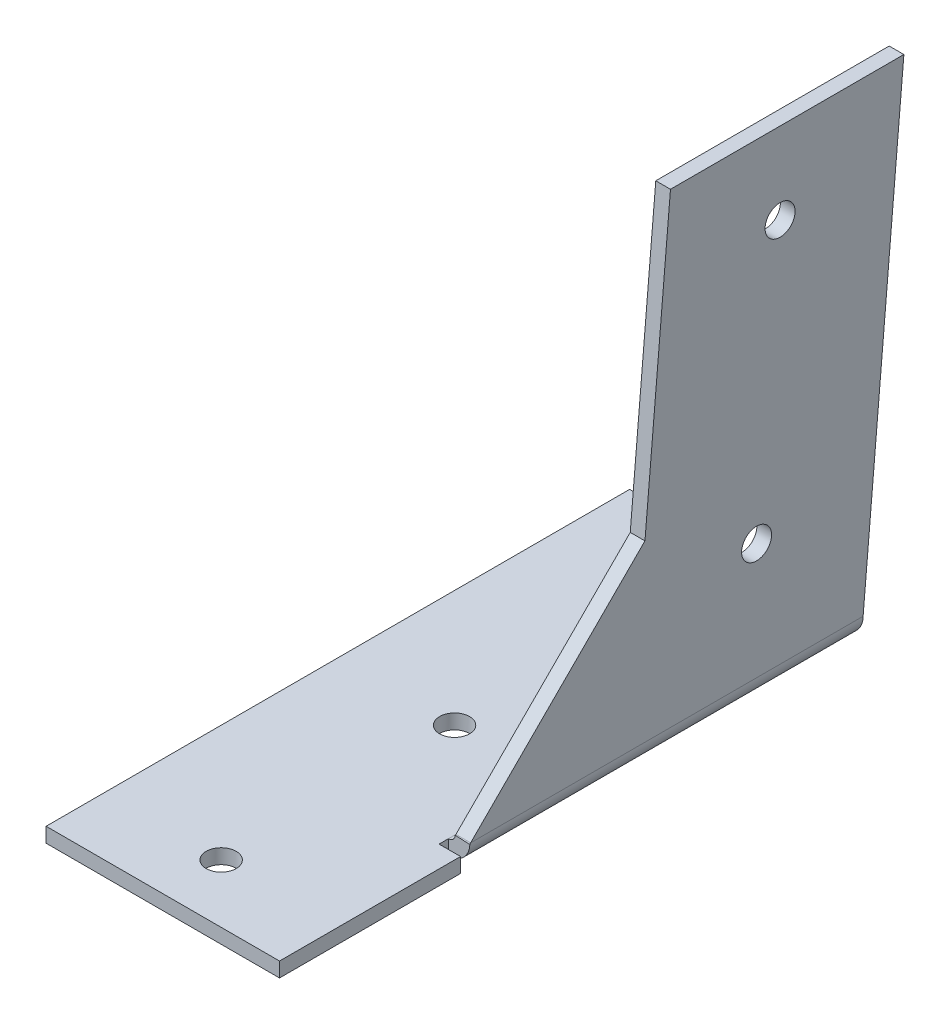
ISO-10303-21;
HEADER;
FILE_DESCRIPTION(('STEP AP214'),'2;1');
FILE_NAME('part.step','',(''),(''),'','','');
FILE_SCHEMA(('AUTOMOTIVE_DESIGN { 1 0 10303 214 1 1 1 1 }'));
ENDSEC;
DATA;
#1=APPLICATION_CONTEXT('core data for automotive mechanical design processes');
#2=APPLICATION_PROTOCOL_DEFINITION('international standard','automotive_design',2000,#1);
#3=PRODUCT_CONTEXT('',#1,'mechanical');
#4=PRODUCT('Part','Part','',(#3));
#5=PRODUCT_RELATED_PRODUCT_CATEGORY('part','',(#4));
#6=PRODUCT_DEFINITION_FORMATION('','',#4);
#7=PRODUCT_DEFINITION_CONTEXT('part definition',#1,'design');
#8=PRODUCT_DEFINITION('design','',#6,#7);
#9=PRODUCT_DEFINITION_SHAPE('','',#8);
#10=(LENGTH_UNIT() NAMED_UNIT(*) SI_UNIT(.MILLI.,.METRE.));
#11=(NAMED_UNIT(*) PLANE_ANGLE_UNIT() SI_UNIT($,.RADIAN.));
#12=(NAMED_UNIT(*) SI_UNIT($,.STERADIAN.) SOLID_ANGLE_UNIT());
#13=UNCERTAINTY_MEASURE_WITH_UNIT(LENGTH_MEASURE(1.E-05),#10,'distance_accuracy_value','');
#14=(GEOMETRIC_REPRESENTATION_CONTEXT(3) GLOBAL_UNCERTAINTY_ASSIGNED_CONTEXT((#13)) GLOBAL_UNIT_ASSIGNED_CONTEXT((#10,
#11,#12)) REPRESENTATION_CONTEXT('',''));
#15=CARTESIAN_POINT('',(0.,0.,0.));
#16=DIRECTION('',(0.,0.,1.));
#17=DIRECTION('',(1.,0.,0.));
#18=AXIS2_PLACEMENT_3D('',#15,#16,#17);
#19=CARTESIAN_POINT('',(12.6999999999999,19.7095572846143,-8.01665904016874));
#20=DIRECTION('',(0.,0.707106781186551,0.707106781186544));
#21=DIRECTION('',(0.,0.707106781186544,-0.707106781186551));
#22=AXIS2_PLACEMENT_3D('',#19,#20,#21);
#23=PLANE('',#22);
#24=DIRECTION('',(0.,0.707106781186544,-0.707106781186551));
#25=VECTOR('',#24,1.);
#26=CARTESIAN_POINT('',(11.0997999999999,19.7095572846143,-8.01665904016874));
#27=LINE('',#26,#25);
#28=CARTESIAN_POINT('',(11.0998,0.736600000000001,10.9562982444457));
#29=VERTEX_POINT('',#28);
#30=CARTESIAN_POINT('',(11.0997999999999,19.7095572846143,-8.01665904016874));
#31=VERTEX_POINT('',#30);
#32=EDGE_CURVE('E204',#29,#31,#27,.T.);
#33=ORIENTED_EDGE('',*,*,#32,.F.);
#34=CARTESIAN_POINT('',(12.7,0.736599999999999,10.9562982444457));
#35=CARTESIAN_POINT('',(11.0998,0.7366,10.9562982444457));
#36=B_SPLINE_CURVE_WITH_KNOTS('',1,(#34,#35),.UNSPECIFIED.,.F.,.F.,(2,2),(0.,1.),.UNSPECIFIED.);
#37=CARTESIAN_POINT('',(12.7,0.736600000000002,10.9562982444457));
#38=VERTEX_POINT('',#37);
#39=EDGE_CURVE('E180',#29,#38,#36,.F.);
#40=ORIENTED_EDGE('',*,*,#39,.T.);
#41=DIRECTION('',(0.,0.707106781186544,-0.707106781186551));
#42=VECTOR('',#41,1.);
#43=CARTESIAN_POINT('',(12.6999999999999,19.7095572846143,-8.01665904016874));
#44=LINE('',#43,#42);
#45=CARTESIAN_POINT('',(12.6999999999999,19.7095572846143,-8.01665904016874));
#46=VERTEX_POINT('',#45);
#47=EDGE_CURVE('E106',#38,#46,#44,.T.);
#48=ORIENTED_EDGE('',*,*,#47,.T.);
#49=DIRECTION('',(-1.,0.,0.));
#50=VECTOR('',#49,1.);
#51=CARTESIAN_POINT('',(12.6999999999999,19.7095572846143,-8.01665904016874));
#52=LINE('',#51,#50);
#53=EDGE_CURVE('E421',#46,#31,#52,.T.);
#54=ORIENTED_EDGE('',*,*,#53,.T.);
#55=EDGE_LOOP('',(#33,#40,#48,#54));
#56=FACE_BOUND('',#55,.T.);
#57=ADVANCED_FACE('F56',(#56),#23,.T.);
#58=CARTESIAN_POINT('',(12.7,0.659557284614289,-31.75));
#59=DIRECTION('',(0.,-0.0871557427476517,-0.996194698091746));
#60=DIRECTION('',(0.,-0.996194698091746,0.0871557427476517));
#61=AXIS2_PLACEMENT_3D('',#58,#59,#60);
#62=PLANE('',#61);
#63=DIRECTION('',(0.,-0.996194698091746,0.0871557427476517));
#64=VECTOR('',#63,1.);
#65=CARTESIAN_POINT('',(12.7,0.659557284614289,-31.75));
#66=LINE('',#65,#64);
#67=CARTESIAN_POINT('',(12.6999999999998,51.4595572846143,-36.1944241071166));
#68=VERTEX_POINT('',#67);
#69=CARTESIAN_POINT('',(12.7,0.736600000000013,-31.7567403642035));
#70=VERTEX_POINT('',#69);
#71=EDGE_CURVE('E258',#68,#70,#66,.T.);
#72=ORIENTED_EDGE('',*,*,#71,.T.);
#73=CARTESIAN_POINT('',(11.0998,0.7366,-31.7567403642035));
#74=CARTESIAN_POINT('',(12.7,0.736599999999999,-31.7567403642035));
#75=B_SPLINE_CURVE_WITH_KNOTS('',1,(#73,#74),.UNSPECIFIED.,.F.,.F.,(2,2),(0.,1.),.UNSPECIFIED.);
#76=CARTESIAN_POINT('',(11.0998,0.736600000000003,-31.7567403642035));
#77=VERTEX_POINT('',#76);
#78=EDGE_CURVE('E12',#70,#77,#75,.F.);
#79=ORIENTED_EDGE('',*,*,#78,.T.);
#80=DIRECTION('',(0.,-0.996194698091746,0.0871557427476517));
#81=VECTOR('',#80,1.);
#82=CARTESIAN_POINT('',(11.0998,0.659557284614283,-31.75));
#83=LINE('',#82,#81);
#84=CARTESIAN_POINT('',(11.0997999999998,51.4595572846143,-36.1944241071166));
#85=VERTEX_POINT('',#84);
#86=EDGE_CURVE('E200',#85,#77,#83,.T.);
#87=ORIENTED_EDGE('',*,*,#86,.F.);
#88=DIRECTION('',(-1.,0.,0.));
#89=VECTOR('',#88,1.);
#90=CARTESIAN_POINT('',(12.6999999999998,51.4595572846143,-36.1944241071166));
#91=LINE('',#90,#89);
#92=EDGE_CURVE('E84',#68,#85,#91,.T.);
#93=ORIENTED_EDGE('',*,*,#92,.F.);
#94=EDGE_LOOP('',(#72,#79,#87,#93));
#95=FACE_BOUND('',#94,.T.);
#96=ADVANCED_FACE('F58',(#95),#62,.T.);
#97=CARTESIAN_POINT('',(12.7,-12.0404427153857,0.));
#98=DIRECTION('',(1.,0.,0.));
#99=DIRECTION('',(0.,0.,-1.));
#100=AXIS2_PLACEMENT_3D('',#97,#98,#99);
#101=PLANE('',#100);
#102=CARTESIAN_POINT('',(12.6999999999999,42.6033864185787,-22.71960955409));
#103=DIRECTION('',(1.,0.,0.));
#104=DIRECTION('',(0.,1.,0.));
#105=AXIS2_PLACEMENT_3D('',#102,#103,#104);
#106=CIRCLE('',#105,1.63195);
#107=CARTESIAN_POINT('',(12.6999999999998,44.2353364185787,-22.71960955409));
#108=VERTEX_POINT('',#107);
#109=EDGE_CURVE('E524',#108,#108,#106,.T.);
#110=ORIENTED_EDGE('',*,*,#109,.F.);
#111=EDGE_LOOP('',(#110));
#112=FACE_BOUND('',#111,.T.);
#113=CARTESIAN_POINT('',(12.7,13.3882726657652,-20.1636182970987));
#114=DIRECTION('',(1.,0.,0.));
#115=DIRECTION('',(0.,1.,0.));
#116=AXIS2_PLACEMENT_3D('',#113,#114,#115);
#117=CIRCLE('',#116,1.63195);
#118=CARTESIAN_POINT('',(12.6999999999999,15.0202226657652,-20.1636182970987));
#119=VERTEX_POINT('',#118);
#120=EDGE_CURVE('E529',#119,#119,#117,.T.);
#121=ORIENTED_EDGE('',*,*,#120,.F.);
#122=EDGE_LOOP('',(#121));
#123=FACE_BOUND('',#122,.T.);
#124=ORIENTED_EDGE('',*,*,#47,.F.);
#125=DIRECTION('',(0.,0.,-1.));
#126=VECTOR('',#125,1.);
#127=CARTESIAN_POINT('',(12.7,0.736600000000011,0.));
#128=LINE('',#127,#126);
#129=EDGE_CURVE('E171',#38,#70,#128,.T.);
#130=ORIENTED_EDGE('',*,*,#129,.T.);
#131=ORIENTED_EDGE('',*,*,#71,.F.);
#132=DIRECTION('',(0.,0.,-1.));
#133=VECTOR('',#132,1.);
#134=CARTESIAN_POINT('',(12.6999999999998,51.4595572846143,-36.1944241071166));
#135=LINE('',#134,#133);
#136=CARTESIAN_POINT('',(12.6999999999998,51.4595572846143,-10.7944241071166));
#137=VERTEX_POINT('',#136);
#138=EDGE_CURVE('E413',#137,#68,#135,.T.);
#139=ORIENTED_EDGE('',*,*,#138,.F.);
#140=DIRECTION('',(0.,0.996194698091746,-0.0871557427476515));
#141=VECTOR('',#140,1.);
#142=CARTESIAN_POINT('',(12.6999999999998,51.4595572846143,-10.7944241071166));
#143=LINE('',#142,#141);
#144=EDGE_CURVE('E199',#46,#137,#143,.T.);
#145=ORIENTED_EDGE('',*,*,#144,.F.);
#146=EDGE_LOOP('',(#124,#130,#131,#139,#145));
#147=FACE_BOUND('',#146,.T.);
#148=ADVANCED_FACE('F196',(#112,#123,#147),#101,.T.);
#149=CARTESIAN_POINT('',(12.6999999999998,51.4595572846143,-36.1944241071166));
#150=DIRECTION('',(0.,1.,0.));
#151=DIRECTION('',(0.,0.,-1.));
#152=AXIS2_PLACEMENT_3D('',#149,#150,#151);
#153=PLANE('',#152);
#154=DIRECTION('',(0.,0.,-1.));
#155=VECTOR('',#154,1.);
#156=CARTESIAN_POINT('',(11.0997999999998,51.4595572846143,-36.1944241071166));
#157=LINE('',#156,#155);
#158=CARTESIAN_POINT('',(11.0997999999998,51.4595572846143,-10.7944241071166));
#159=VERTEX_POINT('',#158);
#160=EDGE_CURVE('E256',#159,#85,#157,.T.);
#161=ORIENTED_EDGE('',*,*,#160,.F.);
#162=DIRECTION('',(-1.,0.,0.));
#163=VECTOR('',#162,1.);
#164=CARTESIAN_POINT('',(12.6999999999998,51.4595572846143,-10.7944241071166));
#165=LINE('',#164,#163);
#166=EDGE_CURVE('E419',#137,#159,#165,.T.);
#167=ORIENTED_EDGE('',*,*,#166,.F.);
#168=ORIENTED_EDGE('',*,*,#138,.T.);
#169=ORIENTED_EDGE('',*,*,#92,.T.);
#170=EDGE_LOOP('',(#161,#167,#168,#169));
#171=FACE_BOUND('',#170,.T.);
#172=ADVANCED_FACE('F235',(#171),#153,.T.);
#173=CARTESIAN_POINT('',(12.6999999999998,51.4595572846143,-10.7944241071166));
#174=DIRECTION('',(0.,0.0871557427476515,0.996194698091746));
#175=DIRECTION('',(0.,0.996194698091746,-0.0871557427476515));
#176=AXIS2_PLACEMENT_3D('',#173,#174,#175);
#177=PLANE('',#176);
#178=DIRECTION('',(0.,0.996194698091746,-0.0871557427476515));
#179=VECTOR('',#178,1.);
#180=CARTESIAN_POINT('',(11.0997999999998,51.4595572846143,-10.7944241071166));
#181=LINE('',#180,#179);
#182=EDGE_CURVE('E415',#31,#159,#181,.T.);
#183=ORIENTED_EDGE('',*,*,#182,.F.);
#184=ORIENTED_EDGE('',*,*,#53,.F.);
#185=ORIENTED_EDGE('',*,*,#144,.T.);
#186=ORIENTED_EDGE('',*,*,#166,.T.);
#187=EDGE_LOOP('',(#183,#184,#185,#186));
#188=FACE_BOUND('',#187,.T.);
#189=ADVANCED_FACE('F226',(#188),#177,.T.);
#190=CARTESIAN_POINT('',(11.0998,-12.0404427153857,0.));
#191=DIRECTION('',(1.,0.,0.));
#192=DIRECTION('',(0.,0.,-1.));
#193=AXIS2_PLACEMENT_3D('',#190,#191,#192);
#194=PLANE('',#193);
#195=CARTESIAN_POINT('',(11.0997999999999,42.6033864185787,-22.71960955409));
#196=DIRECTION('',(-1.,0.,0.));
#197=DIRECTION('',(0.,-1.,0.));
#198=AXIS2_PLACEMENT_3D('',#195,#196,#197);
#199=CIRCLE('',#198,1.63195);
#200=CARTESIAN_POINT('',(11.0997999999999,40.9714364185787,-22.71960955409));
#201=VERTEX_POINT('',#200);
#202=EDGE_CURVE('E240',#201,#201,#199,.T.);
#203=ORIENTED_EDGE('',*,*,#202,.F.);
#204=EDGE_LOOP('',(#203));
#205=FACE_BOUND('',#204,.T.);
#206=CARTESIAN_POINT('',(11.0998,13.3882726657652,-20.1636182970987));
#207=DIRECTION('',(-1.,0.,0.));
#208=DIRECTION('',(0.,-1.,0.));
#209=AXIS2_PLACEMENT_3D('',#206,#207,#208);
#210=CIRCLE('',#209,1.63195);
#211=CARTESIAN_POINT('',(11.0998,11.7563226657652,-20.1636182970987));
#212=VERTEX_POINT('',#211);
#213=EDGE_CURVE('E244',#212,#212,#210,.T.);
#214=ORIENTED_EDGE('',*,*,#213,.F.);
#215=EDGE_LOOP('',(#214));
#216=FACE_BOUND('',#215,.T.);
#217=DIRECTION('',(0.,0.,-1.));
#218=VECTOR('',#217,1.);
#219=CARTESIAN_POINT('',(11.0998,0.736600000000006,0.));
#220=LINE('',#219,#218);
#221=EDGE_CURVE('E67',#29,#77,#220,.T.);
#222=ORIENTED_EDGE('',*,*,#221,.F.);
#223=ORIENTED_EDGE('',*,*,#32,.T.);
#224=ORIENTED_EDGE('',*,*,#182,.T.);
#225=ORIENTED_EDGE('',*,*,#160,.T.);
#226=ORIENTED_EDGE('',*,*,#86,.T.);
#227=EDGE_LOOP('',(#222,#223,#224,#225,#226));
#228=FACE_BOUND('',#227,.T.);
#229=ADVANCED_FACE('F223',(#205,#216,#228),#194,.F.);
#230=CARTESIAN_POINT('',(-12.7,-1.6002,31.75));
#231=DIRECTION('',(-1.,0.,0.));
#232=DIRECTION('',(0.,0.,1.));
#233=AXIS2_PLACEMENT_3D('',#230,#231,#232);
#234=PLANE('',#233);
#235=DIRECTION('',(0.,0.,1.));
#236=VECTOR('',#235,1.);
#237=CARTESIAN_POINT('',(-12.7,0.,31.75));
#238=LINE('',#237,#236);
#239=CARTESIAN_POINT('',(-12.7,0.,-31.75));
#240=VERTEX_POINT('',#239);
#241=CARTESIAN_POINT('',(-12.7,0.,31.75));
#242=VERTEX_POINT('',#241);
#243=EDGE_CURVE('E371',#240,#242,#238,.T.);
#244=ORIENTED_EDGE('',*,*,#243,.F.);
#245=DIRECTION('',(0.,1.,0.));
#246=VECTOR('',#245,1.);
#247=CARTESIAN_POINT('',(-12.7,-1.6002,-31.75));
#248=LINE('',#247,#246);
#249=CARTESIAN_POINT('',(-12.7,-1.6002,-31.75));
#250=VERTEX_POINT('',#249);
#251=EDGE_CURVE('E352',#250,#240,#248,.T.);
#252=ORIENTED_EDGE('',*,*,#251,.F.);
#253=DIRECTION('',(0.,0.,1.));
#254=VECTOR('',#253,1.);
#255=CARTESIAN_POINT('',(-12.7,-1.6002,31.75));
#256=LINE('',#255,#254);
#257=CARTESIAN_POINT('',(-12.7,-1.6002,31.75));
#258=VERTEX_POINT('',#257);
#259=EDGE_CURVE('E405',#250,#258,#256,.T.);
#260=ORIENTED_EDGE('',*,*,#259,.T.);
#261=DIRECTION('',(0.,1.,0.));
#262=VECTOR('',#261,1.);
#263=CARTESIAN_POINT('',(-12.7,-1.6002,31.75));
#264=LINE('',#263,#262);
#265=EDGE_CURVE('E403',#258,#242,#264,.T.);
#266=ORIENTED_EDGE('',*,*,#265,.T.);
#267=EDGE_LOOP('',(#244,#252,#260,#266));
#268=FACE_BOUND('',#267,.T.);
#269=ADVANCED_FACE('F225',(#268),#234,.T.);
#270=CARTESIAN_POINT('',(-12.7,-1.6002,31.75));
#271=DIRECTION('',(0.,0.,1.));
#272=DIRECTION('',(1.,0.,0.));
#273=AXIS2_PLACEMENT_3D('',#270,#271,#272);
#274=PLANE('',#273);
#275=DIRECTION('',(1.,0.,0.));
#276=VECTOR('',#275,1.);
#277=CARTESIAN_POINT('',(-12.7,0.,31.75));
#278=LINE('',#277,#276);
#279=CARTESIAN_POINT('',(12.7,0.,31.75));
#280=VERTEX_POINT('',#279);
#281=EDGE_CURVE('E368',#242,#280,#278,.T.);
#282=ORIENTED_EDGE('',*,*,#281,.F.);
#283=ORIENTED_EDGE('',*,*,#265,.F.);
#284=DIRECTION('',(1.,0.,0.));
#285=VECTOR('',#284,1.);
#286=CARTESIAN_POINT('',(-12.7,-1.6002,31.75));
#287=LINE('',#286,#285);
#288=CARTESIAN_POINT('',(12.7,-1.6002,31.75));
#289=VERTEX_POINT('',#288);
#290=EDGE_CURVE('E400',#258,#289,#287,.T.);
#291=ORIENTED_EDGE('',*,*,#290,.T.);
#292=DIRECTION('',(0.,1.,0.));
#293=VECTOR('',#292,1.);
#294=CARTESIAN_POINT('',(12.7,-1.6002,31.75));
#295=LINE('',#294,#293);
#296=EDGE_CURVE('E398',#289,#280,#295,.T.);
#297=ORIENTED_EDGE('',*,*,#296,.T.);
#298=EDGE_LOOP('',(#282,#283,#291,#297));
#299=FACE_BOUND('',#298,.T.);
#300=ADVANCED_FACE('F232',(#299),#274,.T.);
#301=CARTESIAN_POINT('',(12.7,-1.6002,31.75));
#302=DIRECTION('',(1.,0.,0.));
#303=DIRECTION('',(0.,0.,-1.));
#304=AXIS2_PLACEMENT_3D('',#301,#302,#303);
#305=PLANE('',#304);
#306=DIRECTION('',(0.,0.,-1.));
#307=VECTOR('',#306,1.);
#308=CARTESIAN_POINT('',(12.7,0.,31.75));
#309=LINE('',#308,#307);
#310=CARTESIAN_POINT('',(12.7,0.,12.0493409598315));
#311=VERTEX_POINT('',#310);
#312=EDGE_CURVE('E365',#280,#311,#309,.T.);
#313=ORIENTED_EDGE('',*,*,#312,.F.);
#314=ORIENTED_EDGE('',*,*,#296,.F.);
#315=DIRECTION('',(0.,0.,-1.));
#316=VECTOR('',#315,1.);
#317=CARTESIAN_POINT('',(12.7,-1.6002,31.75));
#318=LINE('',#317,#316);
#319=CARTESIAN_POINT('',(12.7,-1.6002,12.0493409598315));
#320=VERTEX_POINT('',#319);
#321=EDGE_CURVE('E395',#289,#320,#318,.T.);
#322=ORIENTED_EDGE('',*,*,#321,.T.);
#323=DIRECTION('',(0.,1.,0.));
#324=VECTOR('',#323,1.);
#325=CARTESIAN_POINT('',(12.7,-1.6002,12.0493409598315));
#326=LINE('',#325,#324);
#327=EDGE_CURVE('E393',#320,#311,#326,.T.);
#328=ORIENTED_EDGE('',*,*,#327,.T.);
#329=EDGE_LOOP('',(#313,#314,#322,#328));
#330=FACE_BOUND('',#329,.T.);
#331=ADVANCED_FACE('F454',(#330),#305,.T.);
#332=CARTESIAN_POINT('',(10.3632,-1.6002,12.0493409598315));
#333=DIRECTION('',(0.,0.,-1.));
#334=DIRECTION('',(-1.,0.,0.));
#335=AXIS2_PLACEMENT_3D('',#332,#333,#334);
#336=PLANE('',#335);
#337=DIRECTION('',(-1.,0.,0.));
#338=VECTOR('',#337,1.);
#339=CARTESIAN_POINT('',(10.3632,0.,12.0493409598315));
#340=LINE('',#339,#338);
#341=CARTESIAN_POINT('',(10.3632,0.,12.0493409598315));
#342=VERTEX_POINT('',#341);
#343=EDGE_CURVE('E362',#311,#342,#340,.T.);
#344=ORIENTED_EDGE('',*,*,#343,.F.);
#345=ORIENTED_EDGE('',*,*,#327,.F.);
#346=DIRECTION('',(-1.,0.,0.));
#347=VECTOR('',#346,1.);
#348=CARTESIAN_POINT('',(10.3632,-1.6002,12.0493409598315));
#349=LINE('',#348,#347);
#350=CARTESIAN_POINT('',(10.3632,-1.6002,12.0493409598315));
#351=VERTEX_POINT('',#350);
#352=EDGE_CURVE('E390',#320,#351,#349,.T.);
#353=ORIENTED_EDGE('',*,*,#352,.T.);
#354=DIRECTION('',(0.,1.,0.));
#355=VECTOR('',#354,1.);
#356=CARTESIAN_POINT('',(10.3632,-1.6002,12.0493409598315));
#357=LINE('',#356,#355);
#358=EDGE_CURVE('E388',#351,#342,#357,.T.);
#359=ORIENTED_EDGE('',*,*,#358,.T.);
#360=EDGE_LOOP('',(#344,#345,#353,#359));
#361=FACE_BOUND('',#360,.T.);
#362=ADVANCED_FACE('F450',(#361),#336,.T.);
#363=CARTESIAN_POINT('',(0.,-1.6002,0.));
#364=DIRECTION('',(0.,-1.,0.));
#365=DIRECTION('',(0.,0.,-1.));
#366=AXIS2_PLACEMENT_3D('',#363,#364,#365);
#367=PLANE('',#366);
#368=CARTESIAN_POINT('',(0.,-1.6002,25.4));
#369=DIRECTION('',(0.,-1.,0.));
#370=DIRECTION('',(0.,0.,-1.));
#371=AXIS2_PLACEMENT_3D('',#368,#369,#370);
#372=CIRCLE('',#371,1.63195);
#373=CARTESIAN_POINT('',(0.,-1.6002,23.76805));
#374=VERTEX_POINT('',#373);
#375=EDGE_CURVE('E502',#374,#374,#372,.T.);
#376=ORIENTED_EDGE('',*,*,#375,.F.);
#377=EDGE_LOOP('',(#376));
#378=FACE_BOUND('',#377,.T.);
#379=CARTESIAN_POINT('',(0.,-1.6002,-25.4));
#380=DIRECTION('',(0.,-1.,0.));
#381=DIRECTION('',(0.,0.,-1.));
#382=AXIS2_PLACEMENT_3D('',#379,#380,#381);
#383=CIRCLE('',#382,1.63195);
#384=CARTESIAN_POINT('',(0.,-1.6002,-27.03195));
#385=VERTEX_POINT('',#384);
#386=EDGE_CURVE('E506',#385,#385,#383,.T.);
#387=ORIENTED_EDGE('',*,*,#386,.F.);
#388=EDGE_LOOP('',(#387));
#389=FACE_BOUND('',#388,.T.);
#390=CARTESIAN_POINT('',(0.,-1.6002,0.));
#391=DIRECTION('',(0.,-1.,0.));
#392=DIRECTION('',(0.,0.,-1.));
#393=AXIS2_PLACEMENT_3D('',#390,#391,#392);
#394=CIRCLE('',#393,1.63195);
#395=CARTESIAN_POINT('',(0.,-1.6002,-1.63195));
#396=VERTEX_POINT('',#395);
#397=EDGE_CURVE('E511',#396,#396,#394,.T.);
#398=ORIENTED_EDGE('',*,*,#397,.F.);
#399=EDGE_LOOP('',(#398));
#400=FACE_BOUND('',#399,.T.);
#401=DIRECTION('',(0.,0.,-1.));
#402=VECTOR('',#401,1.);
#403=CARTESIAN_POINT('',(10.3632,-1.6002,0.));
#404=LINE('',#403,#402);
#405=CARTESIAN_POINT('',(10.3632,-1.6002,11.0333409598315));
#406=VERTEX_POINT('',#405);
#407=CARTESIAN_POINT('',(10.3632,-1.6002,-31.75));
#408=VERTEX_POINT('',#407);
#409=EDGE_CURVE('E410',#406,#408,#404,.T.);
#410=ORIENTED_EDGE('',*,*,#409,.F.);
#411=DIRECTION('',(0.,0.,-1.));
#412=VECTOR('',#411,1.);
#413=CARTESIAN_POINT('',(10.3632,-1.6002,11.0333409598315));
#414=LINE('',#413,#412);
#415=EDGE_CURVE('E385',#351,#406,#414,.T.);
#416=ORIENTED_EDGE('',*,*,#415,.F.);
#417=ORIENTED_EDGE('',*,*,#352,.F.);
#418=ORIENTED_EDGE('',*,*,#321,.F.);
#419=ORIENTED_EDGE('',*,*,#290,.F.);
#420=ORIENTED_EDGE('',*,*,#259,.F.);
#421=DIRECTION('',(-1.,0.,0.));
#422=VECTOR('',#421,1.);
#423=CARTESIAN_POINT('',(-12.7,-1.6002,-31.75));
#424=LINE('',#423,#422);
#425=EDGE_CURVE('E360',#408,#250,#424,.T.);
#426=ORIENTED_EDGE('',*,*,#425,.F.);
#427=EDGE_LOOP('',(#410,#416,#417,#418,#419,#420,#426));
#428=FACE_BOUND('',#427,.T.);
#429=ADVANCED_FACE('F446',(#378,#389,#400,#428),#367,.T.);
#430=CARTESIAN_POINT('',(10.3632,-1.6002,11.0333409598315));
#431=DIRECTION('',(1.,0.,0.));
#432=DIRECTION('',(0.,0.,-1.));
#433=AXIS2_PLACEMENT_3D('',#430,#431,#432);
#434=PLANE('',#433);
#435=DIRECTION('',(0.,0.,-1.));
#436=VECTOR('',#435,1.);
#437=CARTESIAN_POINT('',(10.3632,0.,11.0333409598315));
#438=LINE('',#437,#436);
#439=CARTESIAN_POINT('',(10.3632,0.,11.0333409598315));
#440=VERTEX_POINT('',#439);
#441=EDGE_CURVE('E379',#342,#440,#438,.T.);
#442=ORIENTED_EDGE('',*,*,#441,.F.);
#443=ORIENTED_EDGE('',*,*,#358,.F.);
#444=ORIENTED_EDGE('',*,*,#415,.T.);
#445=DIRECTION('',(0.,1.,0.));
#446=VECTOR('',#445,1.);
#447=CARTESIAN_POINT('',(10.3632,-1.6002,11.0333409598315));
#448=LINE('',#447,#446);
#449=EDGE_CURVE('E382',#406,#440,#448,.T.);
#450=ORIENTED_EDGE('',*,*,#449,.T.);
#451=EDGE_LOOP('',(#442,#443,#444,#450));
#452=FACE_BOUND('',#451,.T.);
#453=ADVANCED_FACE('F442',(#452),#434,.T.);
#454=CARTESIAN_POINT('',(0.,0.,0.));
#455=DIRECTION('',(0.,-1.,0.));
#456=DIRECTION('',(0.,0.,-1.));
#457=AXIS2_PLACEMENT_3D('',#454,#455,#456);
#458=PLANE('',#457);
#459=CARTESIAN_POINT('',(0.,0.,25.4));
#460=DIRECTION('',(0.,1.,0.));
#461=DIRECTION('',(0.,0.,1.));
#462=AXIS2_PLACEMENT_3D('',#459,#460,#461);
#463=CIRCLE('',#462,1.63195);
#464=CARTESIAN_POINT('',(0.,0.,27.03195));
#465=VERTEX_POINT('',#464);
#466=EDGE_CURVE('E521',#465,#465,#463,.T.);
#467=ORIENTED_EDGE('',*,*,#466,.F.);
#468=EDGE_LOOP('',(#467));
#469=FACE_BOUND('',#468,.T.);
#470=CARTESIAN_POINT('',(0.,0.,-25.4));
#471=DIRECTION('',(0.,1.,0.));
#472=DIRECTION('',(0.,0.,1.));
#473=AXIS2_PLACEMENT_3D('',#470,#471,#472);
#474=CIRCLE('',#473,1.63195);
#475=CARTESIAN_POINT('',(0.,0.,-23.76805));
#476=VERTEX_POINT('',#475);
#477=EDGE_CURVE('E520',#476,#476,#474,.T.);
#478=ORIENTED_EDGE('',*,*,#477,.F.);
#479=EDGE_LOOP('',(#478));
#480=FACE_BOUND('',#479,.T.);
#481=CARTESIAN_POINT('',(0.,0.,0.));
#482=DIRECTION('',(0.,1.,0.));
#483=DIRECTION('',(0.,0.,1.));
#484=AXIS2_PLACEMENT_3D('',#481,#482,#483);
#485=CIRCLE('',#484,1.63195);
#486=CARTESIAN_POINT('',(0.,0.,1.63195));
#487=VERTEX_POINT('',#486);
#488=EDGE_CURVE('E517',#487,#487,#485,.T.);
#489=ORIENTED_EDGE('',*,*,#488,.F.);
#490=EDGE_LOOP('',(#489));
#491=FACE_BOUND('',#490,.T.);
#492=ORIENTED_EDGE('',*,*,#441,.T.);
#493=DIRECTION('',(0.,0.,-1.));
#494=VECTOR('',#493,1.);
#495=CARTESIAN_POINT('',(10.3632,0.,0.));
#496=LINE('',#495,#494);
#497=CARTESIAN_POINT('',(10.3632,0.,-31.75));
#498=VERTEX_POINT('',#497);
#499=EDGE_CURVE('E376',#440,#498,#496,.T.);
#500=ORIENTED_EDGE('',*,*,#499,.T.);
#501=DIRECTION('',(-1.,0.,0.));
#502=VECTOR('',#501,1.);
#503=CARTESIAN_POINT('',(-12.7,0.,-31.75));
#504=LINE('',#503,#502);
#505=EDGE_CURVE('E374',#498,#240,#504,.T.);
#506=ORIENTED_EDGE('',*,*,#505,.T.);
#507=ORIENTED_EDGE('',*,*,#243,.T.);
#508=ORIENTED_EDGE('',*,*,#281,.T.);
#509=ORIENTED_EDGE('',*,*,#312,.T.);
#510=ORIENTED_EDGE('',*,*,#343,.T.);
#511=EDGE_LOOP('',(#492,#500,#506,#507,#508,#509,#510));
#512=FACE_BOUND('',#511,.T.);
#513=ADVANCED_FACE('F438',(#469,#480,#491,#512),#458,.F.);
#514=CARTESIAN_POINT('',(-12.7,-1.6002,-31.75));
#515=DIRECTION('',(0.,0.,-1.));
#516=DIRECTION('',(-1.,0.,0.));
#517=AXIS2_PLACEMENT_3D('',#514,#515,#516);
#518=PLANE('',#517);
#519=DIRECTION('',(0.,1.,0.));
#520=VECTOR('',#519,1.);
#521=CARTESIAN_POINT('',(10.3632,-1.6002,-31.75));
#522=LINE('',#521,#520);
#523=EDGE_CURVE('E408',#408,#498,#522,.T.);
#524=ORIENTED_EDGE('',*,*,#523,.F.);
#525=ORIENTED_EDGE('',*,*,#425,.T.);
#526=ORIENTED_EDGE('',*,*,#251,.T.);
#527=ORIENTED_EDGE('',*,*,#505,.F.);
#528=EDGE_LOOP('',(#524,#525,#526,#527));
#529=FACE_BOUND('',#528,.T.);
#530=ADVANCED_FACE('F435',(#529),#518,.T.);
#531=CARTESIAN_POINT('',(12.7,0.736599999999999,10.9562982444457));
#532=CARTESIAN_POINT('',(12.7,0.697548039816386,10.9819791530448));
#533=CARTESIAN_POINT('',(12.6990208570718,0.65849609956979,11.0076600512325));
#534=CARTESIAN_POINT('',(12.6970638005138,0.619493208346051,11.0333409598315));
#535=CARTESIAN_POINT('',(11.0998,0.7366,10.9562982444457));
#536=CARTESIAN_POINT('',(11.0998,0.724290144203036,10.9819791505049));
#537=CARTESIAN_POINT('',(11.0994913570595,0.711980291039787,11.0076600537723));
#538=CARTESIAN_POINT('',(11.0988744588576,0.69968590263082,11.0333409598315));
#539=B_SPLINE_SURFACE_WITH_KNOTS('',1,3,((#531,#532,#533,#534),(#535,#536,#537,#538)),
.UNSPECIFIED.,.F.,.F.,.F.,(2,2),(4,4),(0.,1.),(0.,1.),.UNSPECIFIED.);
#540=CARTESIAN_POINT('',(11.0998,0.7366,10.9562982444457));
#541=CARTESIAN_POINT('',(11.0998,0.724290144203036,10.9819791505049));
#542=CARTESIAN_POINT('',(11.0994913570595,0.711980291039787,11.0076600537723));
#543=CARTESIAN_POINT('',(11.0988744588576,0.69968590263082,11.0333409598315));
#544=B_SPLINE_CURVE_WITH_KNOTS('',3,(#540,#541,#542,#543),.UNSPECIFIED.,.F.,.F.,(4,4),(0.,1.),.UNSPECIFIED.);
#545=CARTESIAN_POINT('',(11.0988744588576,0.69968590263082,11.0333409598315));
#546=VERTEX_POINT('',#545);
#547=EDGE_CURVE('E492',#29,#546,#544,.T.);
#548=CARTESIAN_POINT('',(11.0988744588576,0.69968590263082,11.0333409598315));
#549=CARTESIAN_POINT('',(12.6970638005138,0.619493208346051,11.0333409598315));
#550=B_SPLINE_CURVE_WITH_KNOTS('',1,(#548,#549),.UNSPECIFIED.,.F.,.F.,(2,2),(0.,1.),.UNSPECIFIED.);
#551=CARTESIAN_POINT('',(12.6970638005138,0.619493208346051,11.0333409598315));
#552=VERTEX_POINT('',#551);
#553=EDGE_CURVE('E188',#546,#552,#550,.T.);
#554=CARTESIAN_POINT('',(12.6970638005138,0.619493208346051,11.0333409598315));
#555=CARTESIAN_POINT('',(12.6990208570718,0.65849609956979,11.0076600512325));
#556=CARTESIAN_POINT('',(12.7,0.697548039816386,10.9819791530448));
#557=CARTESIAN_POINT('',(12.7,0.736599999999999,10.9562982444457));
#558=B_SPLINE_CURVE_WITH_KNOTS('',3,(#554,#555,#556,#557),.UNSPECIFIED.,.F.,.F.,(4,4),(0.,1.),.UNSPECIFIED.);
#559=EDGE_CURVE('E175',#38,#552,#558,.F.);
#560=ORIENTED_EDGE('',*,*,#39,.F.);
#561=ORIENTED_EDGE('',*,*,#547,.T.);
#562=ORIENTED_EDGE('',*,*,#553,.T.);
#563=ORIENTED_EDGE('',*,*,#559,.F.);
#564=EDGE_LOOP('',(#560,#561,#562,#563));
#565=FACE_BOUND('',#564,.T.);
#566=ADVANCED_FACE('F184',(#565),#539,.T.);
#567=CARTESIAN_POINT('',(10.3632,0.7366,11.0333409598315));
#568=DIRECTION('',(0.,0.,1.));
#569=DIRECTION('',(1.,0.,0.));
#570=AXIS2_PLACEMENT_3D('',#567,#568,#569);
#571=PLANE('',#570);
#572=ORIENTED_EDGE('',*,*,#553,.F.);
#573=CARTESIAN_POINT('',(10.3632,0.7366,11.0333409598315));
#574=DIRECTION('',(0.,0.,1.));
#575=DIRECTION('',(1.,0.,0.));
#576=AXIS2_PLACEMENT_3D('',#573,#574,#575);
#577=CIRCLE('',#576,0.7366);
#578=EDGE_CURVE('E479',#546,#440,#577,.F.);
#579=ORIENTED_EDGE('',*,*,#578,.T.);
#580=ORIENTED_EDGE('',*,*,#449,.F.);
#581=CARTESIAN_POINT('',(10.3632,0.7366,11.0333409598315));
#582=DIRECTION('',(0.,0.,-1.));
#583=DIRECTION('',(1.,0.,0.));
#584=AXIS2_PLACEMENT_3D('',#581,#582,#583);
#585=CIRCLE('',#584,2.3368);
#586=EDGE_CURVE('E191',#552,#406,#585,.T.);
#587=ORIENTED_EDGE('',*,*,#586,.F.);
#588=EDGE_LOOP('',(#572,#579,#580,#587));
#589=FACE_BOUND('',#588,.T.);
#590=ADVANCED_FACE('F323',(#589),#571,.T.);
#591=CARTESIAN_POINT('',(10.3632,0.7366,-31.75));
#592=DIRECTION('',(0.,0.,-1.));
#593=DIRECTION('',(-1.,0.,0.));
#594=AXIS2_PLACEMENT_3D('',#591,#592,#593);
#595=PLANE('',#594);
#596=ORIENTED_EDGE('',*,*,#523,.T.);
#597=CARTESIAN_POINT('',(10.3632,0.7366,-31.75));
#598=DIRECTION('',(0.,0.,1.));
#599=DIRECTION('',(1.,0.,0.));
#600=AXIS2_PLACEMENT_3D('',#597,#598,#599);
#601=CIRCLE('',#600,0.7366);
#602=CARTESIAN_POINT('',(11.0988744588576,0.69968590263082,-31.75));
#603=VERTEX_POINT('',#602);
#604=EDGE_CURVE('E503',#498,#603,#601,.T.);
#605=ORIENTED_EDGE('',*,*,#604,.T.);
#606=CARTESIAN_POINT('',(12.6970638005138,0.619493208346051,-31.75));
#607=CARTESIAN_POINT('',(11.0988744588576,0.69968590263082,-31.75));
#608=B_SPLINE_CURVE_WITH_KNOTS('',1,(#606,#607),.UNSPECIFIED.,.F.,.F.,(2,2),(0.,1.),.UNSPECIFIED.);
#609=CARTESIAN_POINT('',(12.6970638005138,0.619493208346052,-31.75));
#610=VERTEX_POINT('',#609);
#611=EDGE_CURVE('E347',#603,#610,#608,.F.);
#612=ORIENTED_EDGE('',*,*,#611,.T.);
#613=CARTESIAN_POINT('',(10.3632,0.7366,-31.75));
#614=DIRECTION('',(0.,0.,1.));
#615=DIRECTION('',(-1.,0.,0.));
#616=AXIS2_PLACEMENT_3D('',#613,#614,#615);
#617=CIRCLE('',#616,2.3368);
#618=EDGE_CURVE('E482',#408,#610,#617,.T.);
#619=ORIENTED_EDGE('',*,*,#618,.F.);
#620=EDGE_LOOP('',(#596,#605,#612,#619));
#621=FACE_BOUND('',#620,.T.);
#622=ADVANCED_FACE('F283',(#621),#595,.T.);
#623=CARTESIAN_POINT('',(12.6970638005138,0.619493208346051,-31.75));
#624=CARTESIAN_POINT('',(12.6990208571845,0.658496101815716,-31.7522467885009));
#625=CARTESIAN_POINT('',(12.7,0.697548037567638,-31.7544935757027));
#626=CARTESIAN_POINT('',(12.7,0.736599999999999,-31.7567403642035));
#627=CARTESIAN_POINT('',(11.0988744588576,0.69968590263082,-31.75));
#628=CARTESIAN_POINT('',(11.0994913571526,0.711980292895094,-31.7522467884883));
#629=CARTESIAN_POINT('',(11.0998,0.724290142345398,-31.7544935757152));
#630=CARTESIAN_POINT('',(11.0998,0.7366,-31.7567403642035));
#631=B_SPLINE_SURFACE_WITH_KNOTS('',1,3,((#623,#624,#625,#626),(#627,#628,#629,#630)),
.UNSPECIFIED.,.F.,.F.,.F.,(2,2),(4,4),(0.,1.),(0.,1.),.UNSPECIFIED.);
#632=CARTESIAN_POINT('',(11.0988744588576,0.69968590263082,-31.75));
#633=CARTESIAN_POINT('',(11.0994913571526,0.711980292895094,-31.7522467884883));
#634=CARTESIAN_POINT('',(11.0998,0.724290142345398,-31.7544935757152));
#635=CARTESIAN_POINT('',(11.0998,0.7366,-31.7567403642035));
#636=B_SPLINE_CURVE_WITH_KNOTS('',3,(#632,#633,#634,#635),.UNSPECIFIED.,.F.,.F.,(4,4),(0.,1.),.UNSPECIFIED.);
#637=EDGE_CURVE('E192',#603,#77,#636,.T.);
#638=CARTESIAN_POINT('',(12.7,0.736599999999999,-31.7567403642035));
#639=CARTESIAN_POINT('',(12.7,0.697548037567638,-31.7544935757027));
#640=CARTESIAN_POINT('',(12.6990208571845,0.658496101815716,-31.7522467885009));
#641=CARTESIAN_POINT('',(12.6970638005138,0.619493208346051,-31.75));
#642=B_SPLINE_CURVE_WITH_KNOTS('',3,(#638,#639,#640,#641),.UNSPECIFIED.,.F.,.F.,(4,4),(0.,1.),.UNSPECIFIED.);
#643=EDGE_CURVE('E74',#610,#70,#642,.F.);
#644=ORIENTED_EDGE('',*,*,#637,.T.);
#645=ORIENTED_EDGE('',*,*,#78,.F.);
#646=ORIENTED_EDGE('',*,*,#643,.F.);
#647=ORIENTED_EDGE('',*,*,#611,.F.);
#648=EDGE_LOOP('',(#644,#645,#646,#647));
#649=FACE_BOUND('',#648,.T.);
#650=ADVANCED_FACE('F261',(#649),#631,.T.);
#651=CARTESIAN_POINT('',(10.3632,0.7366,-53.2463037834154));
#652=DIRECTION('',(0.,0.,1.));
#653=DIRECTION('',(1.,0.,0.));
#654=AXIS2_PLACEMENT_3D('',#651,#652,#653);
#655=CYLINDRICAL_SURFACE('',#654,2.3368);
#656=ORIENTED_EDGE('',*,*,#618,.T.);
#657=ORIENTED_EDGE('',*,*,#643,.T.);
#658=ORIENTED_EDGE('',*,*,#129,.F.);
#659=ORIENTED_EDGE('',*,*,#559,.T.);
#660=ORIENTED_EDGE('',*,*,#586,.T.);
#661=ORIENTED_EDGE('',*,*,#409,.T.);
#662=EDGE_LOOP('',(#656,#657,#658,#659,#660,#661));
#663=FACE_BOUND('',#662,.T.);
#664=ADVANCED_FACE('F173',(#663),#655,.T.);
#665=CARTESIAN_POINT('',(10.3632,0.7366,-53.2463037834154));
#666=DIRECTION('',(0.,0.,1.));
#667=DIRECTION('',(1.,0.,0.));
#668=AXIS2_PLACEMENT_3D('',#665,#666,#667);
#669=CYLINDRICAL_SURFACE('',#668,0.7366);
#670=ORIENTED_EDGE('',*,*,#604,.F.);
#671=ORIENTED_EDGE('',*,*,#499,.F.);
#672=ORIENTED_EDGE('',*,*,#578,.F.);
#673=ORIENTED_EDGE('',*,*,#547,.F.);
#674=ORIENTED_EDGE('',*,*,#221,.T.);
#675=ORIENTED_EDGE('',*,*,#637,.F.);
#676=EDGE_LOOP('',(#670,#671,#672,#673,#674,#675));
#677=FACE_BOUND('',#676,.T.);
#678=ADVANCED_FACE('F336',(#677),#669,.F.);
#679=CARTESIAN_POINT('',(0.,-2.54,0.));
#680=DIRECTION('',(0.,1.,0.));
#681=DIRECTION('',(0.,0.,1.));
#682=AXIS2_PLACEMENT_3D('',#679,#680,#681);
#683=CYLINDRICAL_SURFACE('',#682,1.63195);
#684=ORIENTED_EDGE('',*,*,#397,.T.);
#685=EDGE_LOOP('',(#684));
#686=FACE_BOUND('',#685,.T.);
#687=ORIENTED_EDGE('',*,*,#488,.T.);
#688=EDGE_LOOP('',(#687));
#689=FACE_BOUND('',#688,.T.);
#690=ADVANCED_FACE('F549',(#686,#689),#683,.F.);
#691=CARTESIAN_POINT('',(0.,-2.54,-25.4));
#692=DIRECTION('',(0.,1.,0.));
#693=DIRECTION('',(0.,0.,1.));
#694=AXIS2_PLACEMENT_3D('',#691,#692,#693);
#695=CYLINDRICAL_SURFACE('',#694,1.63195);
#696=ORIENTED_EDGE('',*,*,#386,.T.);
#697=EDGE_LOOP('',(#696));
#698=FACE_BOUND('',#697,.T.);
#699=ORIENTED_EDGE('',*,*,#477,.T.);
#700=EDGE_LOOP('',(#699));
#701=FACE_BOUND('',#700,.T.);
#702=ADVANCED_FACE('F546',(#698,#701),#695,.F.);
#703=CARTESIAN_POINT('',(0.,-2.54,25.4));
#704=DIRECTION('',(0.,1.,0.));
#705=DIRECTION('',(0.,0.,1.));
#706=AXIS2_PLACEMENT_3D('',#703,#704,#705);
#707=CYLINDRICAL_SURFACE('',#706,1.63195);
#708=ORIENTED_EDGE('',*,*,#375,.T.);
#709=EDGE_LOOP('',(#708));
#710=FACE_BOUND('',#709,.T.);
#711=ORIENTED_EDGE('',*,*,#466,.T.);
#712=EDGE_LOOP('',(#711));
#713=FACE_BOUND('',#712,.T.);
#714=ADVANCED_FACE('F542',(#710,#713),#707,.F.);
#715=CARTESIAN_POINT('',(13.6398,13.3882726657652,-20.1636182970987));
#716=DIRECTION('',(-1.,0.,0.));
#717=DIRECTION('',(0.,-1.,0.));
#718=AXIS2_PLACEMENT_3D('',#715,#716,#717);
#719=CYLINDRICAL_SURFACE('',#718,1.63195);
#720=ORIENTED_EDGE('',*,*,#120,.T.);
#721=EDGE_LOOP('',(#720));
#722=FACE_BOUND('',#721,.T.);
#723=ORIENTED_EDGE('',*,*,#213,.T.);
#724=EDGE_LOOP('',(#723));
#725=FACE_BOUND('',#724,.T.);
#726=ADVANCED_FACE('F536',(#722,#725),#719,.F.);
#727=CARTESIAN_POINT('',(13.6397999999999,42.6033864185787,-22.71960955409));
#728=DIRECTION('',(-1.,0.,0.));
#729=DIRECTION('',(0.,-1.,0.));
#730=AXIS2_PLACEMENT_3D('',#727,#728,#729);
#731=CYLINDRICAL_SURFACE('',#730,1.63195);
#732=ORIENTED_EDGE('',*,*,#109,.T.);
#733=EDGE_LOOP('',(#732));
#734=FACE_BOUND('',#733,.T.);
#735=ORIENTED_EDGE('',*,*,#202,.T.);
#736=EDGE_LOOP('',(#735));
#737=FACE_BOUND('',#736,.T.);
#738=ADVANCED_FACE('F534',(#734,#737),#731,.F.);
#739=CLOSED_SHELL('',(#57,#96,#148,#172,#189,#229,#269,#300,#331,#362,#429,#453,#513,#530,#566,
#590,#622,#650,#664,#678,#690,#702,#714,#726,#738));
#740=MANIFOLD_SOLID_BREP('B2',#739);
#741=ADVANCED_BREP_SHAPE_REPRESENTATION('',(#18,#740),#14);
#742=SHAPE_DEFINITION_REPRESENTATION(#9,#741);
ENDSEC;
END-ISO-10303-21;
